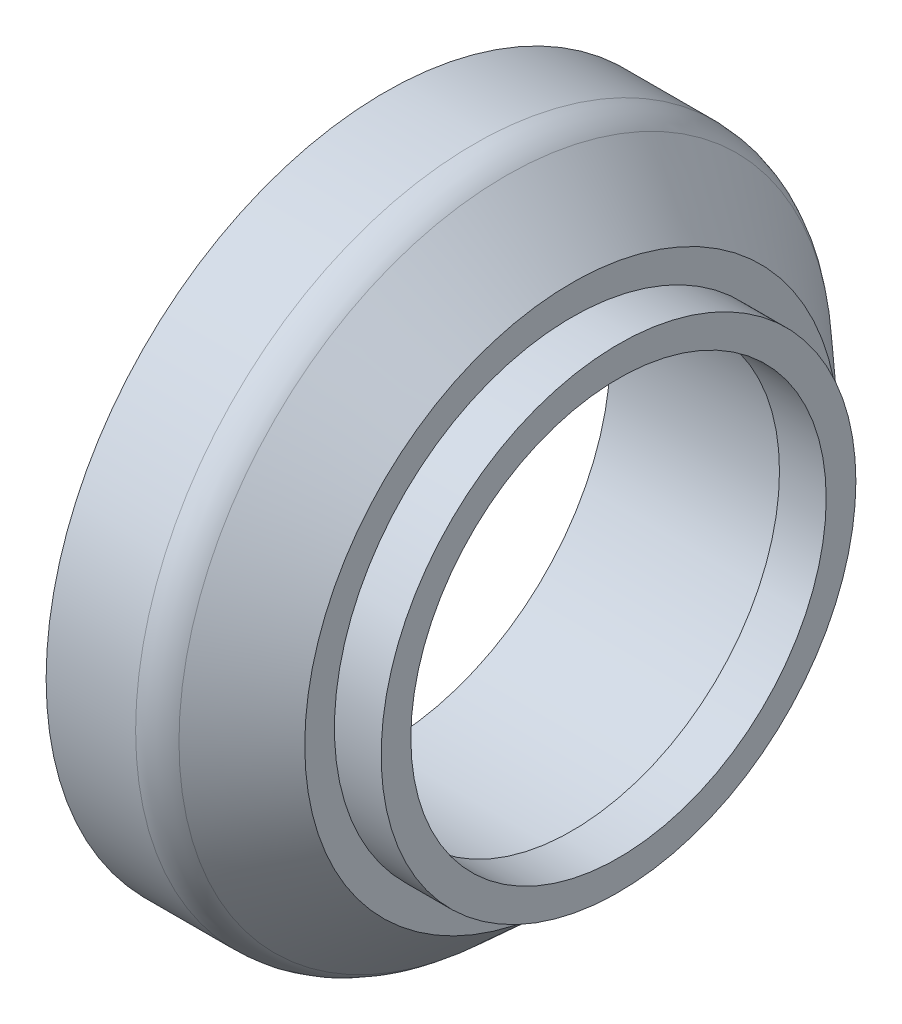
from build123d import *

# Parameters (mm, degrees)
FILLET1_R                    = 10
SKETCH2_R                    = 50.8
SKETCH2_R_2                  = 44.45
BOSS_EXTRUDE1_DEPTH          = 10
SKETCH3_R                    = 5.35
CUT_EXTRUDE1_DEPTH           = 19.4
CHAMFER1_SIZE                = 1
CIRPATTERN1_COUNT            = 12
CHAMFER1_OF_CIRPATTERN1_SIZE = 1


with BuildPart() as part:
    # Sketch1 → Revolve1 (revolve)
    with BuildSketch(Plane.XY, mode=Mode.PRIVATE) as revolve1_sk:
        Polygon((0, 48.25), (40, 48.25), (40, 57.15), (23, 72.5), (0, 72.5), align=None)
    revolve(revolve1_sk.sketch.rotate(Axis((0, 0, 0), (1, 0, 0)), 90), axis=Axis((0, 0, 0), (1, 0, 0)))

    # Fillet1
    fillet1_edges = [part.edges().sort_by_distance(p)[0] for p in [
        (23, 0, -72.5),
    ]]
    fillet(fillet1_edges, radius=FILLET1_R)

    # Sketch2 → Boss-Extrude1 (add)
    with BuildSketch(Plane(origin=(40, 0, 0), x_dir=(0, 0, -1), z_dir=(1, 0, 0))):
        Circle(SKETCH2_R)
        Circle(SKETCH2_R_2, mode=Mode.SUBTRACT)
    extrude(amount=BOSS_EXTRUDE1_DEPTH)

    # Sketch3 → Cut-Extrude1 (cut)
    with BuildSketch(Plane.ZY):
        with Locations((0, 62.5)):
            Circle(SKETCH3_R)
    cut_extrude1 = extrude(amount=-CUT_EXTRUDE1_DEPTH, mode=Mode.SUBTRACT)

    # Chamfer1
    chamfer1_edges = [part.edges().sort_by_distance(p)[0] for p in [
        (0, 62.5, -5.35),
    ]]
    chamfer(chamfer1_edges, length=CHAMFER1_SIZE)

    # CirPattern1: Cut-Extrude1 ×12 about axis
    cirpattern1_axis = Axis((0, 0, 0), (1, 0, 0))
    for i in range(1, CIRPATTERN1_COUNT):
        add(cut_extrude1.rotate(cirpattern1_axis, i * 360 / CIRPATTERN1_COUNT), mode=Mode.SUBTRACT)

    # Chamfer1 of CirPattern1
    chamfer1_of_cirpattern1_edges = [part.edges().sort_by_distance(p)[0] for p in [
        (0, 56.801587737, 26.61676409),
        (0, 35.88323591, 51.451587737),
        (0, 5.35, 62.5),
        (0, -26.61676409, 56.801587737),
        (0, -51.451587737, 35.88323591),
        (0, -62.5, 5.35),
        (0, -56.801587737, -26.61676409),
        (0, -35.88323591, -51.451587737),
        (0, -5.35, -62.5),
        (0, 26.61676409, -56.801587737),
        (0, 51.451587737, -35.88323591),
    ]]
    chamfer(chamfer1_of_cirpattern1_edges, length=CHAMFER1_OF_CIRPATTERN1_SIZE)


solid = part.part
